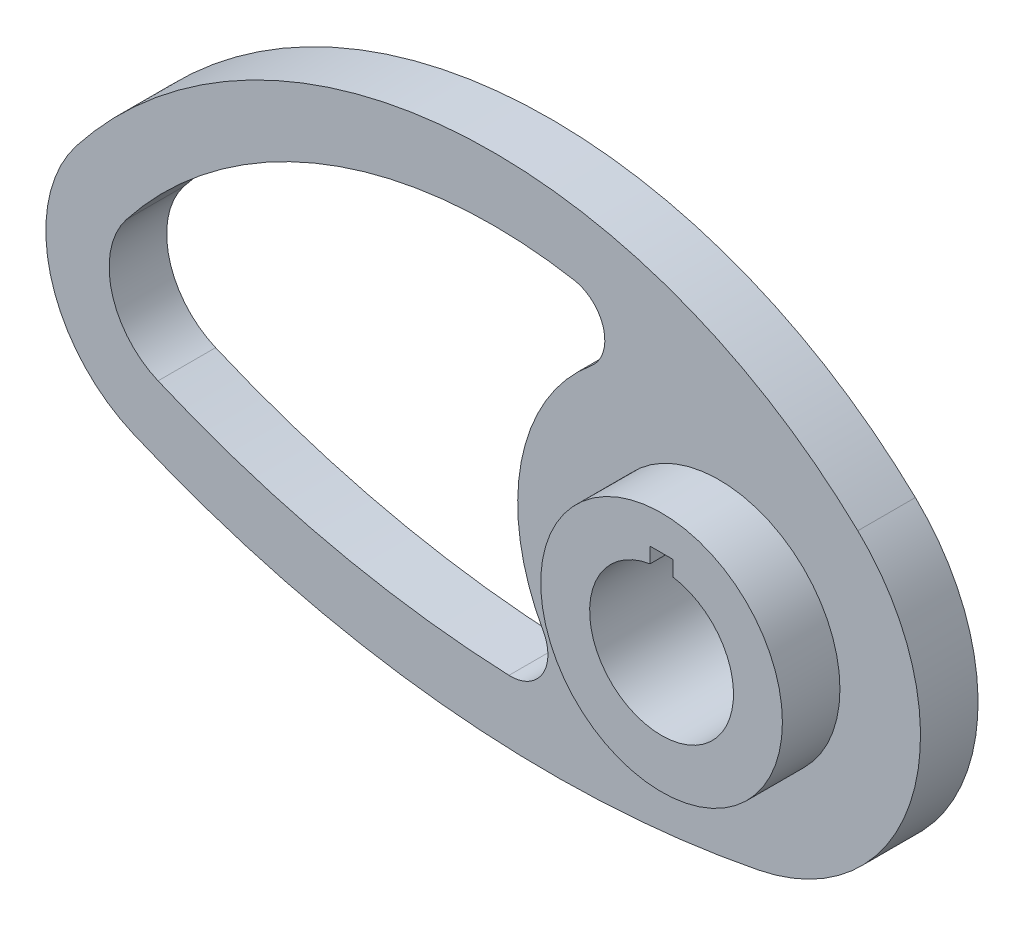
from build123d import *

# Parameters (mm, degrees)
BASE_EXTRUDE_DEPTH  = 5
CUT_EXTRUDE1_DEPTH  = 128.895136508
SKETCH3_R           = 21
BOSS_EXTRUDE1_DEPTH = 10
CUT_EXTRUDE2_DEPTH  = 130.062643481


with BuildPart() as part:
    # Sketch1 → Base-Extrude (new, symmetric)
    with BuildSketch(Plane.XY):
        with BuildLine():
            ThreePointArc((6.802173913, -34.332643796), (33.616445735, -9.743437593), (24.107551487, 25.373725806))
            ThreePointArc((24.107551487, 25.373725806), (-45.987491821, 50.430835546), (-111.678780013, 15.419001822))
            ThreePointArc((-111.678780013, 15.419001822), (-116.215050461, -6.215410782), (-101.819972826, -22.990609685))
            ThreePointArc((-101.819972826, -22.990609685), (-48.364925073, -36.859745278), (6.802173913, -34.332643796))
        make_face()
    extrude(amount=BASE_EXTRUDE_DEPTH, both=True)

    # Sketch2 → Cut-Extrude1 (cut, through all)
    with BuildSketch(Plane.XY.offset(5)):
        with BuildLine():
            ThreePointArc((-97.499184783, -12.874741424), (-67.636809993, -22.55079542), (-36.521882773, -26.703957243))
            ThreePointArc((-36.521882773, -26.703957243), (-30.712880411, -23.619804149), (-30.569402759, -17.044401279))
            ThreePointArc((-30.569402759, -17.044401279), (-34.390231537, 6.50476555), (-22.232601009, 27.031674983))
            ThreePointArc((-22.232601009, 27.031674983), (-20.075213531, 33.70485369), (-25.236065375, 38.453668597))
            ThreePointArc((-25.236065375, 38.453668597), (-68.25521915, 34.309923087), (-103.020116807, 8.634641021))
            ThreePointArc((-103.020116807, 8.634641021), (-105.560428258, -3.480630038), (-97.499184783, -12.874741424))
        make_face()
    extrude(amount=-CUT_EXTRUDE1_DEPTH, mode=Mode.SUBTRACT)

    # Sketch3 → Boss-Extrude1 (add)
    with BuildSketch(Plane.XY.offset(5)):
        Circle(SKETCH3_R)
    extrude(amount=BOSS_EXTRUDE1_DEPTH)

    # Sketch4 → Cut-Extrude2 (cut, through all)
    with BuildSketch(Plane.XY.offset(15)):
        with BuildLine():
            Line((-2, 12.338962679), (-2, 15))
            Line((-2, 15), (2, 15))
            Line((2, 15), (2, 12.338962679))
            ThreePointArc((2, 12.338962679), (0, -12.5), (-2, 12.338962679))
        make_face()
    extrude(amount=-CUT_EXTRUDE2_DEPTH, mode=Mode.SUBTRACT)


solid = part.part
